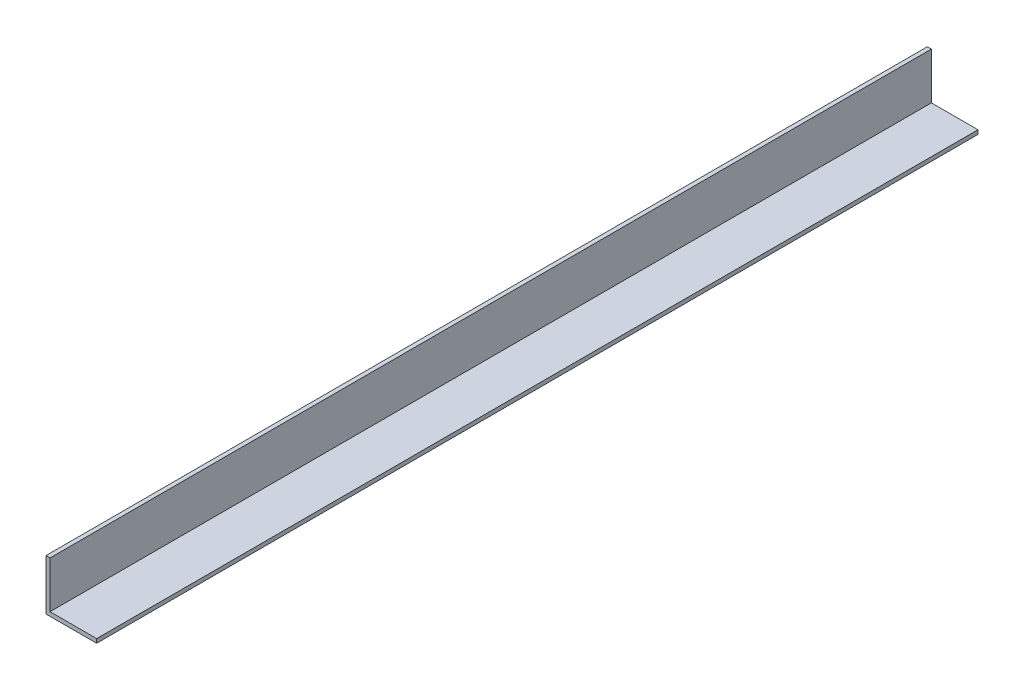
ISO-10303-21;
HEADER;
FILE_DESCRIPTION(('STEP AP214'),'2;1');
FILE_NAME('part.step','',(''),(''),'','','');
FILE_SCHEMA(('AUTOMOTIVE_DESIGN { 1 0 10303 214 1 1 1 1 }'));
ENDSEC;
DATA;
#1=APPLICATION_CONTEXT('core data for automotive mechanical design processes');
#2=APPLICATION_PROTOCOL_DEFINITION('international standard','automotive_design',2000,#1);
#3=PRODUCT_CONTEXT('',#1,'mechanical');
#4=PRODUCT('Part','Part','',(#3));
#5=PRODUCT_RELATED_PRODUCT_CATEGORY('part','',(#4));
#6=PRODUCT_DEFINITION_FORMATION('','',#4);
#7=PRODUCT_DEFINITION_CONTEXT('part definition',#1,'design');
#8=PRODUCT_DEFINITION('design','',#6,#7);
#9=PRODUCT_DEFINITION_SHAPE('','',#8);
#10=(LENGTH_UNIT() NAMED_UNIT(*) SI_UNIT(.MILLI.,.METRE.));
#11=(NAMED_UNIT(*) PLANE_ANGLE_UNIT() SI_UNIT($,.RADIAN.));
#12=(NAMED_UNIT(*) SI_UNIT($,.STERADIAN.) SOLID_ANGLE_UNIT());
#13=UNCERTAINTY_MEASURE_WITH_UNIT(LENGTH_MEASURE(1.E-05),#10,'distance_accuracy_value','');
#14=(GEOMETRIC_REPRESENTATION_CONTEXT(3) GLOBAL_UNCERTAINTY_ASSIGNED_CONTEXT((#13)) GLOBAL_UNIT_ASSIGNED_CONTEXT((#10,
#11,#12)) REPRESENTATION_CONTEXT('',''));
#15=CARTESIAN_POINT('',(0.,0.,0.));
#16=DIRECTION('',(0.,0.,1.));
#17=DIRECTION('',(1.,0.,0.));
#18=AXIS2_PLACEMENT_3D('',#15,#16,#17);
#19=CARTESIAN_POINT('',(0.,0.,-870.));
#20=DIRECTION('',(0.,-1.,0.));
#21=DIRECTION('',(0.,0.,-1.));
#22=AXIS2_PLACEMENT_3D('',#19,#20,#21);
#23=PLANE('',#22);
#24=DIRECTION('',(1.,0.,0.));
#25=VECTOR('',#24,1.);
#26=CARTESIAN_POINT('',(0.,0.,0.));
#27=LINE('',#26,#25);
#28=CARTESIAN_POINT('',(0.,0.,0.));
#29=VERTEX_POINT('',#28);
#30=CARTESIAN_POINT('',(49.9999999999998,0.,0.));
#31=VERTEX_POINT('',#30);
#32=EDGE_CURVE('E76',#29,#31,#27,.T.);
#33=ORIENTED_EDGE('',*,*,#32,.F.);
#34=DIRECTION('',(0.,0.,1.));
#35=VECTOR('',#34,1.);
#36=CARTESIAN_POINT('',(0.,0.,-870.));
#37=LINE('',#36,#35);
#38=CARTESIAN_POINT('',(0.,0.,-870.));
#39=VERTEX_POINT('',#38);
#40=EDGE_CURVE('E11',#39,#29,#37,.T.);
#41=ORIENTED_EDGE('',*,*,#40,.F.);
#42=DIRECTION('',(1.,0.,0.));
#43=VECTOR('',#42,1.);
#44=CARTESIAN_POINT('',(0.,0.,-870.));
#45=LINE('',#44,#43);
#46=CARTESIAN_POINT('',(49.9999999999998,0.,-870.));
#47=VERTEX_POINT('',#46);
#48=EDGE_CURVE('E78',#39,#47,#45,.T.);
#49=ORIENTED_EDGE('',*,*,#48,.T.);
#50=DIRECTION('',(0.,0.,1.));
#51=VECTOR('',#50,1.);
#52=CARTESIAN_POINT('',(49.9999999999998,0.,-870.));
#53=LINE('',#52,#51);
#54=EDGE_CURVE('E27',#47,#31,#53,.T.);
#55=ORIENTED_EDGE('',*,*,#54,.T.);
#56=EDGE_LOOP('',(#33,#41,#49,#55));
#57=FACE_BOUND('',#56,.T.);
#58=ADVANCED_FACE('F24',(#57),#23,.T.);
#59=CARTESIAN_POINT('',(0.,50.00000000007,-870.));
#60=DIRECTION('',(-1.,0.,0.));
#61=DIRECTION('',(0.,-1.,0.));
#62=AXIS2_PLACEMENT_3D('',#59,#60,#61);
#63=PLANE('',#62);
#64=DIRECTION('',(0.,-1.,0.));
#65=VECTOR('',#64,1.);
#66=CARTESIAN_POINT('',(0.,50.00000000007,0.));
#67=LINE('',#66,#65);
#68=CARTESIAN_POINT('',(0.,50.00000000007,0.));
#69=VERTEX_POINT('',#68);
#70=EDGE_CURVE('E94',#69,#29,#67,.T.);
#71=ORIENTED_EDGE('',*,*,#70,.F.);
#72=DIRECTION('',(0.,0.,1.));
#73=VECTOR('',#72,1.);
#74=CARTESIAN_POINT('',(0.,50.00000000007,-870.));
#75=LINE('',#74,#73);
#76=CARTESIAN_POINT('',(0.,50.00000000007,-870.));
#77=VERTEX_POINT('',#76);
#78=EDGE_CURVE('E32',#77,#69,#75,.T.);
#79=ORIENTED_EDGE('',*,*,#78,.F.);
#80=DIRECTION('',(0.,-1.,0.));
#81=VECTOR('',#80,1.);
#82=CARTESIAN_POINT('',(0.,50.00000000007,-870.));
#83=LINE('',#82,#81);
#84=EDGE_CURVE('E83',#77,#39,#83,.T.);
#85=ORIENTED_EDGE('',*,*,#84,.T.);
#86=ORIENTED_EDGE('',*,*,#40,.T.);
#87=EDGE_LOOP('',(#71,#79,#85,#86));
#88=FACE_BOUND('',#87,.T.);
#89=ADVANCED_FACE('F129',(#88),#63,.T.);
#90=CARTESIAN_POINT('',(0.,50.00000000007,-870.));
#91=DIRECTION('',(0.,1.,0.));
#92=DIRECTION('',(0.,0.,1.));
#93=AXIS2_PLACEMENT_3D('',#90,#91,#92);
#94=PLANE('',#93);
#95=DIRECTION('',(-1.,0.,0.));
#96=VECTOR('',#95,1.);
#97=CARTESIAN_POINT('',(0.,50.00000000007,0.));
#98=LINE('',#97,#96);
#99=CARTESIAN_POINT('',(3.99999999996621,50.00000000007,0.));
#100=VERTEX_POINT('',#99);
#101=EDGE_CURVE('E101',#100,#69,#98,.T.);
#102=ORIENTED_EDGE('',*,*,#101,.F.);
#103=DIRECTION('',(0.,0.,1.));
#104=VECTOR('',#103,1.);
#105=CARTESIAN_POINT('',(3.99999999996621,50.00000000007,-870.));
#106=LINE('',#105,#104);
#107=CARTESIAN_POINT('',(3.99999999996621,50.00000000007,-870.));
#108=VERTEX_POINT('',#107);
#109=EDGE_CURVE('E117',#108,#100,#106,.T.);
#110=ORIENTED_EDGE('',*,*,#109,.F.);
#111=DIRECTION('',(-1.,0.,0.));
#112=VECTOR('',#111,1.);
#113=CARTESIAN_POINT('',(0.,50.00000000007,-870.));
#114=LINE('',#113,#112);
#115=EDGE_CURVE('E113',#108,#77,#114,.T.);
#116=ORIENTED_EDGE('',*,*,#115,.T.);
#117=ORIENTED_EDGE('',*,*,#78,.T.);
#118=EDGE_LOOP('',(#102,#110,#116,#117));
#119=FACE_BOUND('',#118,.T.);
#120=ADVANCED_FACE('F134',(#119),#94,.T.);
#121=CARTESIAN_POINT('',(3.99999999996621,3.99999999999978,-870.));
#122=DIRECTION('',(1.,0.,0.));
#123=DIRECTION('',(0.,0.,-1.));
#124=AXIS2_PLACEMENT_3D('',#121,#122,#123);
#125=PLANE('',#124);
#126=DIRECTION('',(0.,1.,0.));
#127=VECTOR('',#126,1.);
#128=CARTESIAN_POINT('',(3.99999999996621,3.99999999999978,0.));
#129=LINE('',#128,#127);
#130=CARTESIAN_POINT('',(3.99999999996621,3.99999999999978,0.));
#131=VERTEX_POINT('',#130);
#132=EDGE_CURVE('E98',#131,#100,#129,.T.);
#133=ORIENTED_EDGE('',*,*,#132,.F.);
#134=DIRECTION('',(0.,0.,1.));
#135=VECTOR('',#134,1.);
#136=CARTESIAN_POINT('',(3.99999999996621,3.99999999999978,-870.));
#137=LINE('',#136,#135);
#138=CARTESIAN_POINT('',(3.99999999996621,3.99999999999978,-870.));
#139=VERTEX_POINT('',#138);
#140=EDGE_CURVE('E119',#139,#131,#137,.T.);
#141=ORIENTED_EDGE('',*,*,#140,.F.);
#142=DIRECTION('',(0.,1.,0.));
#143=VECTOR('',#142,1.);
#144=CARTESIAN_POINT('',(3.99999999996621,3.99999999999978,-870.));
#145=LINE('',#144,#143);
#146=EDGE_CURVE('E110',#139,#108,#145,.T.);
#147=ORIENTED_EDGE('',*,*,#146,.T.);
#148=ORIENTED_EDGE('',*,*,#109,.T.);
#149=EDGE_LOOP('',(#133,#141,#147,#148));
#150=FACE_BOUND('',#149,.T.);
#151=ADVANCED_FACE('F126',(#150),#125,.T.);
#152=CARTESIAN_POINT('',(3.99999999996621,3.99999999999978,-870.));
#153=DIRECTION('',(0.,1.,0.));
#154=DIRECTION('',(0.,0.,1.));
#155=AXIS2_PLACEMENT_3D('',#152,#153,#154);
#156=PLANE('',#155);
#157=DIRECTION('',(-1.,0.,0.));
#158=VECTOR('',#157,1.);
#159=CARTESIAN_POINT('',(3.99999999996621,3.99999999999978,0.));
#160=LINE('',#159,#158);
#161=CARTESIAN_POINT('',(49.9999999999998,3.99999999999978,0.));
#162=VERTEX_POINT('',#161);
#163=EDGE_CURVE('E90',#162,#131,#160,.T.);
#164=ORIENTED_EDGE('',*,*,#163,.F.);
#165=DIRECTION('',(0.,0.,1.));
#166=VECTOR('',#165,1.);
#167=CARTESIAN_POINT('',(49.9999999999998,3.99999999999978,-870.));
#168=LINE('',#167,#166);
#169=CARTESIAN_POINT('',(49.9999999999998,3.99999999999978,-870.));
#170=VERTEX_POINT('',#169);
#171=EDGE_CURVE('E82',#170,#162,#168,.T.);
#172=ORIENTED_EDGE('',*,*,#171,.F.);
#173=DIRECTION('',(-1.,0.,0.));
#174=VECTOR('',#173,1.);
#175=CARTESIAN_POINT('',(3.99999999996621,3.99999999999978,-870.));
#176=LINE('',#175,#174);
#177=EDGE_CURVE('E107',#170,#139,#176,.T.);
#178=ORIENTED_EDGE('',*,*,#177,.T.);
#179=ORIENTED_EDGE('',*,*,#140,.T.);
#180=EDGE_LOOP('',(#164,#172,#178,#179));
#181=FACE_BOUND('',#180,.T.);
#182=ADVANCED_FACE('F122',(#181),#156,.T.);
#183=CARTESIAN_POINT('',(49.9999999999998,0.,-870.));
#184=DIRECTION('',(1.,0.,0.));
#185=DIRECTION('',(0.,0.,-1.));
#186=AXIS2_PLACEMENT_3D('',#183,#184,#185);
#187=PLANE('',#186);
#188=DIRECTION('',(0.,1.,0.));
#189=VECTOR('',#188,1.);
#190=CARTESIAN_POINT('',(49.9999999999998,0.,0.));
#191=LINE('',#190,#189);
#192=EDGE_CURVE('E85',#31,#162,#191,.T.);
#193=ORIENTED_EDGE('',*,*,#192,.F.);
#194=ORIENTED_EDGE('',*,*,#54,.F.);
#195=DIRECTION('',(0.,1.,0.));
#196=VECTOR('',#195,1.);
#197=CARTESIAN_POINT('',(49.9999999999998,0.,-870.));
#198=LINE('',#197,#196);
#199=EDGE_CURVE('E105',#47,#170,#198,.T.);
#200=ORIENTED_EDGE('',*,*,#199,.T.);
#201=ORIENTED_EDGE('',*,*,#171,.T.);
#202=EDGE_LOOP('',(#193,#194,#200,#201));
#203=FACE_BOUND('',#202,.T.);
#204=ADVANCED_FACE('F86',(#203),#187,.T.);
#205=CARTESIAN_POINT('',(49.9999999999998,0.,-870.));
#206=DIRECTION('',(0.,0.,1.));
#207=DIRECTION('',(1.,0.,0.));
#208=AXIS2_PLACEMENT_3D('',#205,#206,#207);
#209=PLANE('',#208);
#210=ORIENTED_EDGE('',*,*,#48,.F.);
#211=ORIENTED_EDGE('',*,*,#84,.F.);
#212=ORIENTED_EDGE('',*,*,#115,.F.);
#213=ORIENTED_EDGE('',*,*,#146,.F.);
#214=ORIENTED_EDGE('',*,*,#177,.F.);
#215=ORIENTED_EDGE('',*,*,#199,.F.);
#216=EDGE_LOOP('',(#210,#211,#212,#213,#214,#215));
#217=FACE_BOUND('',#216,.T.);
#218=ADVANCED_FACE('F133',(#217),#209,.F.);
#219=CARTESIAN_POINT('',(49.9999999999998,0.,0.));
#220=DIRECTION('',(0.,0.,1.));
#221=DIRECTION('',(1.,0.,0.));
#222=AXIS2_PLACEMENT_3D('',#219,#220,#221);
#223=PLANE('',#222);
#224=ORIENTED_EDGE('',*,*,#32,.T.);
#225=ORIENTED_EDGE('',*,*,#192,.T.);
#226=ORIENTED_EDGE('',*,*,#163,.T.);
#227=ORIENTED_EDGE('',*,*,#132,.T.);
#228=ORIENTED_EDGE('',*,*,#101,.T.);
#229=ORIENTED_EDGE('',*,*,#70,.T.);
#230=EDGE_LOOP('',(#224,#225,#226,#227,#228,#229));
#231=FACE_BOUND('',#230,.T.);
#232=ADVANCED_FACE('F92',(#231),#223,.T.);
#233=CLOSED_SHELL('',(#58,#89,#120,#151,#182,#204,#218,#232));
#234=MANIFOLD_SOLID_BREP('B2',#233);
#235=ADVANCED_BREP_SHAPE_REPRESENTATION('',(#18,#234),#14);
#236=SHAPE_DEFINITION_REPRESENTATION(#9,#235);
ENDSEC;
END-ISO-10303-21;
